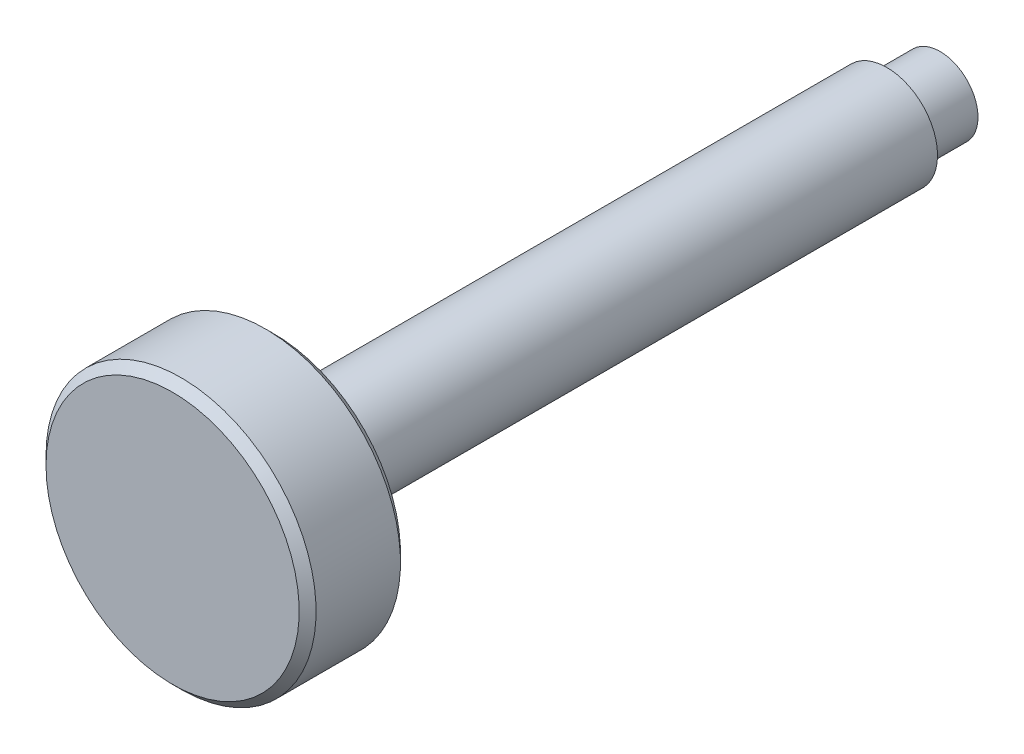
ISO-10303-21;
HEADER;
FILE_DESCRIPTION(('STEP AP214'),'2;1');
FILE_NAME('part.step','',(''),(''),'','','');
FILE_SCHEMA(('AUTOMOTIVE_DESIGN { 1 0 10303 214 1 1 1 1 }'));
ENDSEC;
DATA;
#1=APPLICATION_CONTEXT('core data for automotive mechanical design processes');
#2=APPLICATION_PROTOCOL_DEFINITION('international standard','automotive_design',2000,#1);
#3=PRODUCT_CONTEXT('',#1,'mechanical');
#4=PRODUCT('Part','Part','',(#3));
#5=PRODUCT_RELATED_PRODUCT_CATEGORY('part','',(#4));
#6=PRODUCT_DEFINITION_FORMATION('','',#4);
#7=PRODUCT_DEFINITION_CONTEXT('part definition',#1,'design');
#8=PRODUCT_DEFINITION('design','',#6,#7);
#9=PRODUCT_DEFINITION_SHAPE('','',#8);
#10=(LENGTH_UNIT() NAMED_UNIT(*) SI_UNIT(.MILLI.,.METRE.));
#11=(NAMED_UNIT(*) PLANE_ANGLE_UNIT() SI_UNIT($,.RADIAN.));
#12=(NAMED_UNIT(*) SI_UNIT($,.STERADIAN.) SOLID_ANGLE_UNIT());
#13=UNCERTAINTY_MEASURE_WITH_UNIT(LENGTH_MEASURE(1.E-05),#10,'distance_accuracy_value','');
#14=(GEOMETRIC_REPRESENTATION_CONTEXT(3) GLOBAL_UNCERTAINTY_ASSIGNED_CONTEXT((#13)) GLOBAL_UNIT_ASSIGNED_CONTEXT((#10,
#11,#12)) REPRESENTATION_CONTEXT('',''));
#15=CARTESIAN_POINT('',(0.,0.,0.));
#16=DIRECTION('',(0.,0.,1.));
#17=DIRECTION('',(1.,0.,0.));
#18=AXIS2_PLACEMENT_3D('',#15,#16,#17);
#19=CARTESIAN_POINT('',(0.,0.,80.));
#20=DIRECTION('',(0.,0.,1.));
#21=DIRECTION('',(1.,0.,0.));
#22=AXIS2_PLACEMENT_3D('',#19,#20,#21);
#23=CYLINDRICAL_SURFACE('',#22,16.);
#24=CARTESIAN_POINT('',(0.,0.,91.));
#25=DIRECTION('',(0.,0.,-1.));
#26=DIRECTION('',(-1.,0.,0.));
#27=AXIS2_PLACEMENT_3D('',#24,#25,#26);
#28=CIRCLE('',#27,16.);
#29=CARTESIAN_POINT('',(-16.,0.,91.));
#30=VERTEX_POINT('',#29);
#31=EDGE_CURVE('E23',#30,#30,#28,.T.);
#32=ORIENTED_EDGE('',*,*,#31,.T.);
#33=EDGE_LOOP('',(#32));
#34=FACE_BOUND('',#33,.T.);
#35=CARTESIAN_POINT('',(0.,0.,81.));
#36=DIRECTION('',(0.,0.,-1.));
#37=DIRECTION('',(-1.,0.,0.));
#38=AXIS2_PLACEMENT_3D('',#35,#36,#37);
#39=CIRCLE('',#38,16.);
#40=CARTESIAN_POINT('',(-16.,0.,81.));
#41=VERTEX_POINT('',#40);
#42=EDGE_CURVE('E27',#41,#41,#39,.F.);
#43=ORIENTED_EDGE('',*,*,#42,.T.);
#44=EDGE_LOOP('',(#43));
#45=FACE_BOUND('',#44,.T.);
#46=ADVANCED_FACE('F12',(#34,#45),#23,.T.);
#47=CARTESIAN_POINT('',(0.,0.,80.));
#48=DIRECTION('',(0.,0.,-1.));
#49=DIRECTION('',(-1.,0.,0.));
#50=AXIS2_PLACEMENT_3D('',#47,#48,#49);
#51=PLANE('',#50);
#52=CARTESIAN_POINT('',(0.,0.,80.));
#53=DIRECTION('',(0.,0.,-1.));
#54=DIRECTION('',(-1.,0.,0.));
#55=AXIS2_PLACEMENT_3D('',#52,#53,#54);
#56=CIRCLE('',#55,15.);
#57=CARTESIAN_POINT('',(-15.,0.,80.));
#58=VERTEX_POINT('',#57);
#59=EDGE_CURVE('E8',#58,#58,#56,.T.);
#60=ORIENTED_EDGE('',*,*,#59,.T.);
#61=EDGE_LOOP('',(#60));
#62=FACE_BOUND('',#61,.T.);
#63=CARTESIAN_POINT('',(0.,0.,80.));
#64=DIRECTION('',(0.,0.,-1.));
#65=DIRECTION('',(-1.,0.,0.));
#66=AXIS2_PLACEMENT_3D('',#63,#64,#65);
#67=CIRCLE('',#66,6.6);
#68=CARTESIAN_POINT('',(-6.6,0.,80.));
#69=VERTEX_POINT('',#68);
#70=EDGE_CURVE('E32',#69,#69,#67,.F.);
#71=ORIENTED_EDGE('',*,*,#70,.T.);
#72=EDGE_LOOP('',(#71));
#73=FACE_BOUND('',#72,.T.);
#74=ADVANCED_FACE('F66',(#62,#73),#51,.T.);
#75=CARTESIAN_POINT('',(0.,0.,92.));
#76=DIRECTION('',(0.,0.,-1.));
#77=DIRECTION('',(-1.,0.,0.));
#78=AXIS2_PLACEMENT_3D('',#75,#76,#77);
#79=PLANE('',#78);
#80=CARTESIAN_POINT('',(0.,0.,92.));
#81=DIRECTION('',(0.,0.,-1.));
#82=DIRECTION('',(-1.,0.,0.));
#83=AXIS2_PLACEMENT_3D('',#80,#81,#82);
#84=CIRCLE('',#83,15.);
#85=CARTESIAN_POINT('',(-15.,0.,92.));
#86=VERTEX_POINT('',#85);
#87=EDGE_CURVE('E19',#86,#86,#84,.F.);
#88=ORIENTED_EDGE('',*,*,#87,.T.);
#89=EDGE_LOOP('',(#88));
#90=FACE_BOUND('',#89,.T.);
#91=ADVANCED_FACE('F72',(#90),#79,.F.);
#92=CARTESIAN_POINT('',(0.,0.,80.));
#93=DIRECTION('',(0.,0.,1.));
#94=DIRECTION('',(1.,0.,0.));
#95=AXIS2_PLACEMENT_3D('',#92,#93,#94);
#96=CYLINDRICAL_SURFACE('',#95,6.);
#97=CARTESIAN_POINT('',(0.,0.,79.4));
#98=DIRECTION('',(0.,0.,-1.));
#99=DIRECTION('',(-1.,0.,0.));
#100=AXIS2_PLACEMENT_3D('',#97,#98,#99);
#101=CIRCLE('',#100,6.);
#102=CARTESIAN_POINT('',(-6.,0.,79.4));
#103=VERTEX_POINT('',#102);
#104=EDGE_CURVE('E35',#103,#103,#101,.T.);
#105=ORIENTED_EDGE('',*,*,#104,.T.);
#106=EDGE_LOOP('',(#105));
#107=FACE_BOUND('',#106,.T.);
#108=CARTESIAN_POINT('',(0.,0.,7.36602540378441));
#109=DIRECTION('',(0.,0.,1.));
#110=DIRECTION('',(1.,0.,0.));
#111=AXIS2_PLACEMENT_3D('',#108,#109,#110);
#112=CIRCLE('',#111,6.);
#113=CARTESIAN_POINT('',(6.,0.,7.36602540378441));
#114=VERTEX_POINT('',#113);
#115=EDGE_CURVE('E38',#114,#114,#112,.T.);
#116=ORIENTED_EDGE('',*,*,#115,.T.);
#117=EDGE_LOOP('',(#116));
#118=FACE_BOUND('',#117,.T.);
#119=ADVANCED_FACE('F125',(#107,#118),#96,.T.);
#120=CARTESIAN_POINT('',(0.,0.,7.36602540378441));
#121=DIRECTION('',(0.,0.,1.));
#122=DIRECTION('',(1.,0.,0.));
#123=AXIS2_PLACEMENT_3D('',#120,#121,#122);
#124=CONICAL_SURFACE('',#123,6.,1.0471975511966);
#125=CARTESIAN_POINT('',(0.,0.,6.5));
#126=DIRECTION('',(0.,0.,1.));
#127=DIRECTION('',(1.,0.,0.));
#128=AXIS2_PLACEMENT_3D('',#125,#126,#127);
#129=CIRCLE('',#128,4.5);
#130=CARTESIAN_POINT('',(4.5,0.,6.5));
#131=VERTEX_POINT('',#130);
#132=EDGE_CURVE('E41',#131,#131,#129,.T.);
#133=ORIENTED_EDGE('',*,*,#132,.T.);
#134=EDGE_LOOP('',(#133));
#135=FACE_BOUND('',#134,.T.);
#136=ORIENTED_EDGE('',*,*,#115,.F.);
#137=EDGE_LOOP('',(#136));
#138=FACE_BOUND('',#137,.T.);
#139=ADVANCED_FACE('F63',(#135,#138),#124,.T.);
#140=CARTESIAN_POINT('',(0.,0.,80.));
#141=DIRECTION('',(0.,0.,1.));
#142=DIRECTION('',(1.,0.,0.));
#143=AXIS2_PLACEMENT_3D('',#140,#141,#142);
#144=CYLINDRICAL_SURFACE('',#143,4.5);
#145=CARTESIAN_POINT('',(0.,0.,1.06971445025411));
#146=DIRECTION('',(0.,0.,1.));
#147=DIRECTION('',(1.,0.,0.));
#148=AXIS2_PLACEMENT_3D('',#145,#146,#147);
#149=CIRCLE('',#148,4.5);
#150=CARTESIAN_POINT('',(4.5,0.,1.06971445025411));
#151=VERTEX_POINT('',#150);
#152=EDGE_CURVE('E44',#151,#151,#149,.T.);
#153=ORIENTED_EDGE('',*,*,#152,.T.);
#154=EDGE_LOOP('',(#153));
#155=FACE_BOUND('',#154,.T.);
#156=ORIENTED_EDGE('',*,*,#132,.F.);
#157=EDGE_LOOP('',(#156));
#158=FACE_BOUND('',#157,.T.);
#159=ADVANCED_FACE('F48',(#155,#158),#144,.T.);
#160=CARTESIAN_POINT('',(0.,0.,10.));
#161=DIRECTION('',(0.,0.,1.));
#162=DIRECTION('',(1.,0.,0.));
#163=AXIS2_PLACEMENT_3D('',#160,#161,#162);
#164=SPHERICAL_SURFACE('',#163,10.);
#165=ORIENTED_EDGE('',*,*,#152,.F.);
#166=EDGE_LOOP('',(#165));
#167=FACE_BOUND('',#166,.T.);
#168=ADVANCED_FACE('F51',(#167),#164,.T.);
#169=CARTESIAN_POINT('',(0.,0.,79.4));
#170=DIRECTION('',(0.,0.,-1.));
#171=DIRECTION('',(-1.,0.,0.));
#172=AXIS2_PLACEMENT_3D('',#169,#170,#171);
#173=TOROIDAL_SURFACE('',#172,6.6,0.6);
#174=ORIENTED_EDGE('',*,*,#70,.F.);
#175=EDGE_LOOP('',(#174));
#176=FACE_BOUND('',#175,.T.);
#177=ORIENTED_EDGE('',*,*,#104,.F.);
#178=EDGE_LOOP('',(#177));
#179=FACE_BOUND('',#178,.T.);
#180=ADVANCED_FACE('F53',(#176,#179),#173,.F.);
#181=CARTESIAN_POINT('',(0.,0.,91.));
#182=DIRECTION('',(0.,0.,-1.));
#183=DIRECTION('',(-1.,0.,0.));
#184=AXIS2_PLACEMENT_3D('',#181,#182,#183);
#185=CONICAL_SURFACE('',#184,16.,0.78539816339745);
#186=ORIENTED_EDGE('',*,*,#87,.F.);
#187=EDGE_LOOP('',(#186));
#188=FACE_BOUND('',#187,.T.);
#189=ORIENTED_EDGE('',*,*,#31,.F.);
#190=EDGE_LOOP('',(#189));
#191=FACE_BOUND('',#190,.T.);
#192=ADVANCED_FACE('F60',(#188,#191),#185,.T.);
#193=CARTESIAN_POINT('',(0.,0.,80.));
#194=DIRECTION('',(0.,0.,1.));
#195=DIRECTION('',(1.,0.,0.));
#196=AXIS2_PLACEMENT_3D('',#193,#194,#195);
#197=CONICAL_SURFACE('',#196,15.,0.78539816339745);
#198=ORIENTED_EDGE('',*,*,#42,.F.);
#199=EDGE_LOOP('',(#198));
#200=FACE_BOUND('',#199,.T.);
#201=ORIENTED_EDGE('',*,*,#59,.F.);
#202=EDGE_LOOP('',(#201));
#203=FACE_BOUND('',#202,.T.);
#204=ADVANCED_FACE('F14',(#200,#203),#197,.T.);
#205=CLOSED_SHELL('',(#46,#74,#91,#119,#139,#159,#168,#180,#192,#204));
#206=MANIFOLD_SOLID_BREP('B1',#205);
#207=ADVANCED_BREP_SHAPE_REPRESENTATION('',(#18,#206),#14);
#208=SHAPE_DEFINITION_REPRESENTATION(#9,#207);
ENDSEC;
END-ISO-10303-21;
